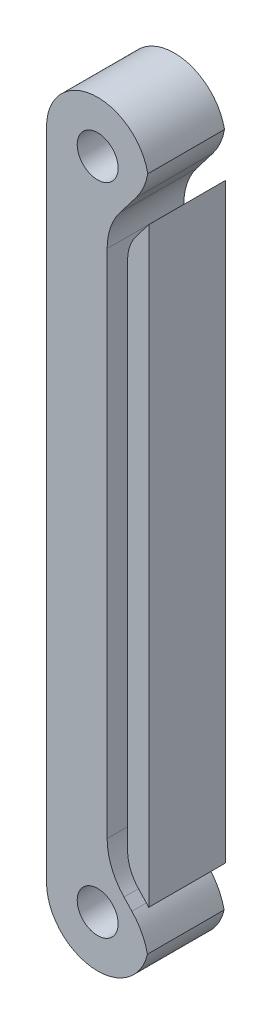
from build123d import *

# Parameters (mm, degrees)
SKETCH1_R           = 2.54
BOSS_EXTRUDE1_DEPTH = 9.525
CUT_EXTRUDE1_DEPTH  = 10.16


with BuildPart() as part:
    # Sketch1 → Boss-Extrude1 (new body)
    with BuildSketch(Plane.XY):
        with BuildLine():
            Line((-6.35, -40.64), (-6.35, 40.64))
            ThreePointArc((-6.35, 40.64), (0, 46.99), (6.35, 40.64))
            Line((6.35, 40.64), (6.35, -40.64))
            ThreePointArc((6.35, -40.64), (0, -46.99), (-6.35, -40.64))
        make_face()
        with Locations(Location((0, 40.64, 0), (0, 0, 180))):
            Circle(SKETCH1_R, mode=Mode.SUBTRACT)
        with Locations(Location((0, -40.64, 0), (0, 0, 180))):
            Circle(SKETCH1_R, mode=Mode.SUBTRACT)
    extrude(amount=BOSS_EXTRUDE1_DEPTH)

    # Sketch2 → Cut-Extrude1 (cut)
    with BuildSketch(Plane.XY.offset(9.525)):
        with BuildLine():
            Line((4.778083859, 38.588938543), (2.748699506, 35.940965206))
            ThreePointArc((2.748699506, 35.940965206), (1.580454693, 33.753008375), (1.176783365, 31.305764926))
            Line((1.176783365, 31.305764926), (1.176783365, -32.147521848))
            ThreePointArc((1.176783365, -32.147521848), (1.719043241, -34.97063976), (3.268645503, -37.39195621))
            Line((3.268645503, -37.39195621), (4.258137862, -38.434976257))
            ThreePointArc((4.258137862, -38.434976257), (5.807740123, -40.856292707), (6.35, -43.679410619))
            Line((6.35, -43.679410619), (8.89, -43.679410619))
            ThreePointArc((8.89, -43.679410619), (8.166986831, -39.915253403), (6.100850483, -36.68683147))
            Line((6.100850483, -36.68683147), (5.111358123, -35.643811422))
            ThreePointArc((5.111358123, -35.643811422), (4.078289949, -34.029600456), (3.716783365, -32.147521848))
            Line((3.716783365, -32.147521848), (3.716783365, 31.305764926))
            ThreePointArc((3.716783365, 31.305764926), (3.985897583, 32.937260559), (4.764727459, 34.395898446))
            Line((4.764727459, 34.395898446), (6.794111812, 37.043871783))
            ThreePointArc((6.794111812, 37.043871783), (8.351771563, 39.961147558), (8.89, 43.224138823))
            Line((8.89, 43.224138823), (6.35, 43.224138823))
            ThreePointArc((6.35, 43.224138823), (5.946328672, 40.776895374), (4.778083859, 38.588938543))
        make_face()
    extrude(amount=-CUT_EXTRUDE1_DEPTH, mode=Mode.SUBTRACT)


with BuildPart() as cut_extrude1_piece_1:
    # of the separate pieces the step leaves, piece 1, a body of its own (cut_extrude1_pieces)
    add(part.part.solids().sort_by_distance((-6.35, -40.64, 0))[0])


with BuildPart() as cut_extrude1_piece_2:
    # of the separate pieces the step leaves, piece 2, a body of its own (cut_extrude1_pieces)
    add(part.part.solids().sort_by_distance((6.35, 36.464387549, 0))[0])


solid = Compound([cut_extrude1_piece_1.part, cut_extrude1_piece_2.part])
